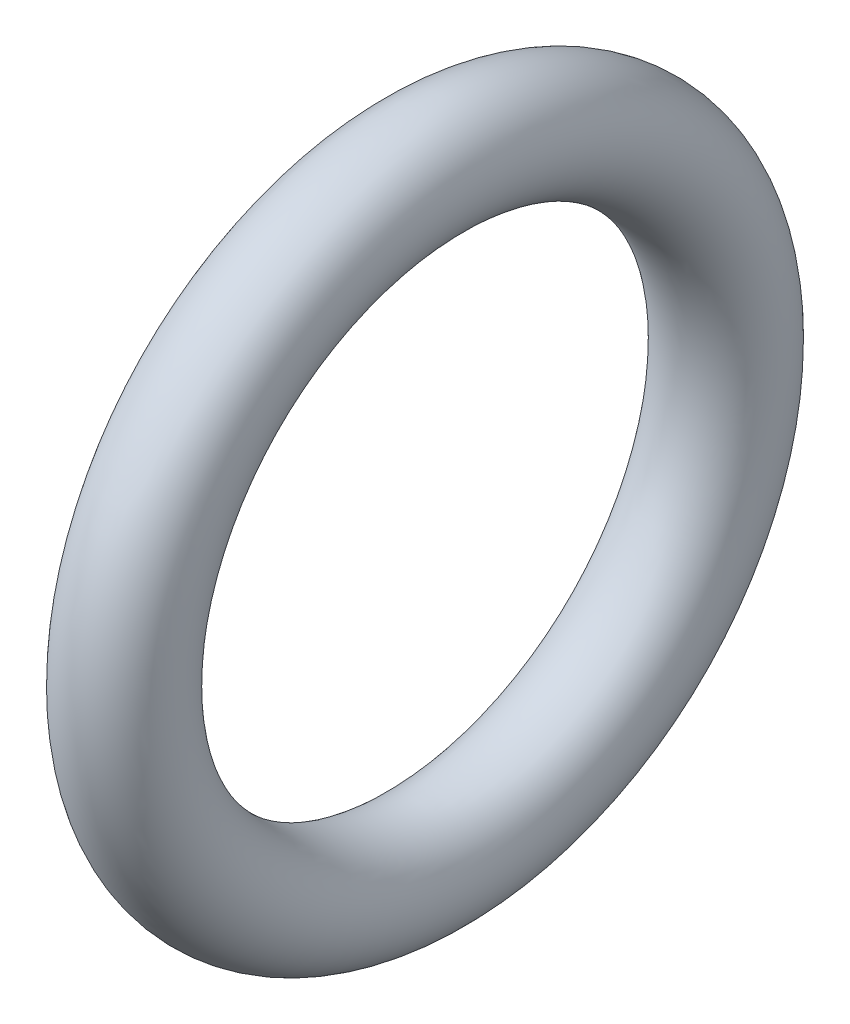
from build123d import *

# Parameters (mm, degrees)
ESQUISSE1_R = 1.35


with BuildPart() as part:
    # Esquisse1 → Base-R_volution (revolve)
    with BuildSketch(Plane.XY, mode=Mode.PRIVATE) as base_r_volution_sk:
        with Locations((0, 7.4)):
            Circle(ESQUISSE1_R)
    revolve(base_r_volution_sk.sketch.rotate(Axis((0, 0, 0), (-1, 0, 0)), 90), axis=Axis((0, 0, 0), (-1, 0, 0)))


solid = part.part
